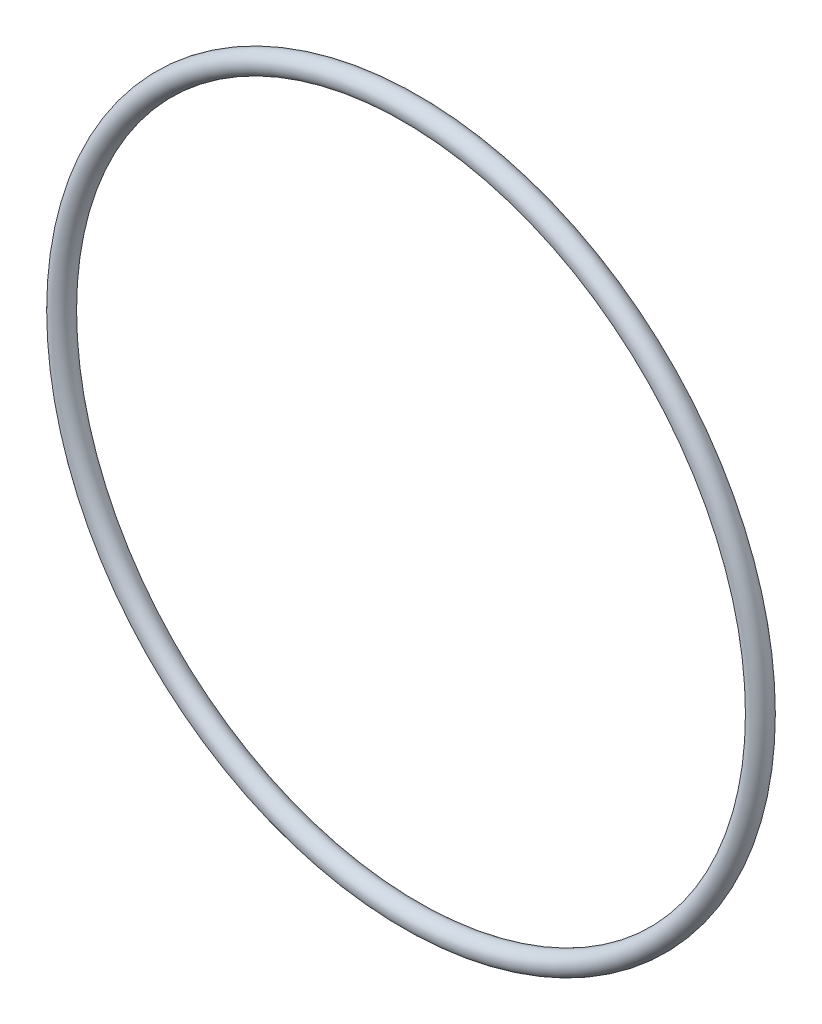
ISO-10303-21;
HEADER;
FILE_DESCRIPTION(('STEP AP214'),'2;1');
FILE_NAME('part.step','',(''),(''),'','','');
FILE_SCHEMA(('AUTOMOTIVE_DESIGN { 1 0 10303 214 1 1 1 1 }'));
ENDSEC;
DATA;
#1=APPLICATION_CONTEXT('core data for automotive mechanical design processes');
#2=APPLICATION_PROTOCOL_DEFINITION('international standard','automotive_design',2000,#1);
#3=PRODUCT_CONTEXT('',#1,'mechanical');
#4=PRODUCT('Part','Part','',(#3));
#5=PRODUCT_RELATED_PRODUCT_CATEGORY('part','',(#4));
#6=PRODUCT_DEFINITION_FORMATION('','',#4);
#7=PRODUCT_DEFINITION_CONTEXT('part definition',#1,'design');
#8=PRODUCT_DEFINITION('design','',#6,#7);
#9=PRODUCT_DEFINITION_SHAPE('','',#8);
#10=(LENGTH_UNIT() NAMED_UNIT(*) SI_UNIT(.MILLI.,.METRE.));
#11=(NAMED_UNIT(*) PLANE_ANGLE_UNIT() SI_UNIT($,.RADIAN.));
#12=(NAMED_UNIT(*) SI_UNIT($,.STERADIAN.) SOLID_ANGLE_UNIT());
#13=UNCERTAINTY_MEASURE_WITH_UNIT(LENGTH_MEASURE(1.E-05),#10,'distance_accuracy_value','');
#14=(GEOMETRIC_REPRESENTATION_CONTEXT(3) GLOBAL_UNCERTAINTY_ASSIGNED_CONTEXT((#13)) GLOBAL_UNIT_ASSIGNED_CONTEXT((#10,
#11,#12)) REPRESENTATION_CONTEXT('',''));
#15=CARTESIAN_POINT('',(0.,0.,0.));
#16=DIRECTION('',(0.,0.,1.));
#17=DIRECTION('',(1.,0.,0.));
#18=AXIS2_PLACEMENT_3D('',#15,#16,#17);
#19=CARTESIAN_POINT('',(0.,0.,0.));
#20=DIRECTION('',(0.,0.,1.));
#21=DIRECTION('',(0.999999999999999,0.,0.));
#22=AXIS2_PLACEMENT_3D('',#19,#20,#21);
#23=TOROIDAL_SURFACE('',#22,29.337,0.889);
#24=CARTESIAN_POINT('',(30.226,0.,0.));
#25=VERTEX_POINT('',#24);
#26=VERTEX_LOOP('',#25);
#27=FACE_BOUND('',#26,.T.);
#28=ADVANCED_FACE('F28',(#27),#23,.T.);
#29=CLOSED_SHELL('',(#28));
#30=MANIFOLD_SOLID_BREP('B2',#29);
#31=ADVANCED_BREP_SHAPE_REPRESENTATION('',(#18,#30),#14);
#32=SHAPE_DEFINITION_REPRESENTATION(#9,#31);
ENDSEC;
END-ISO-10303-21;
